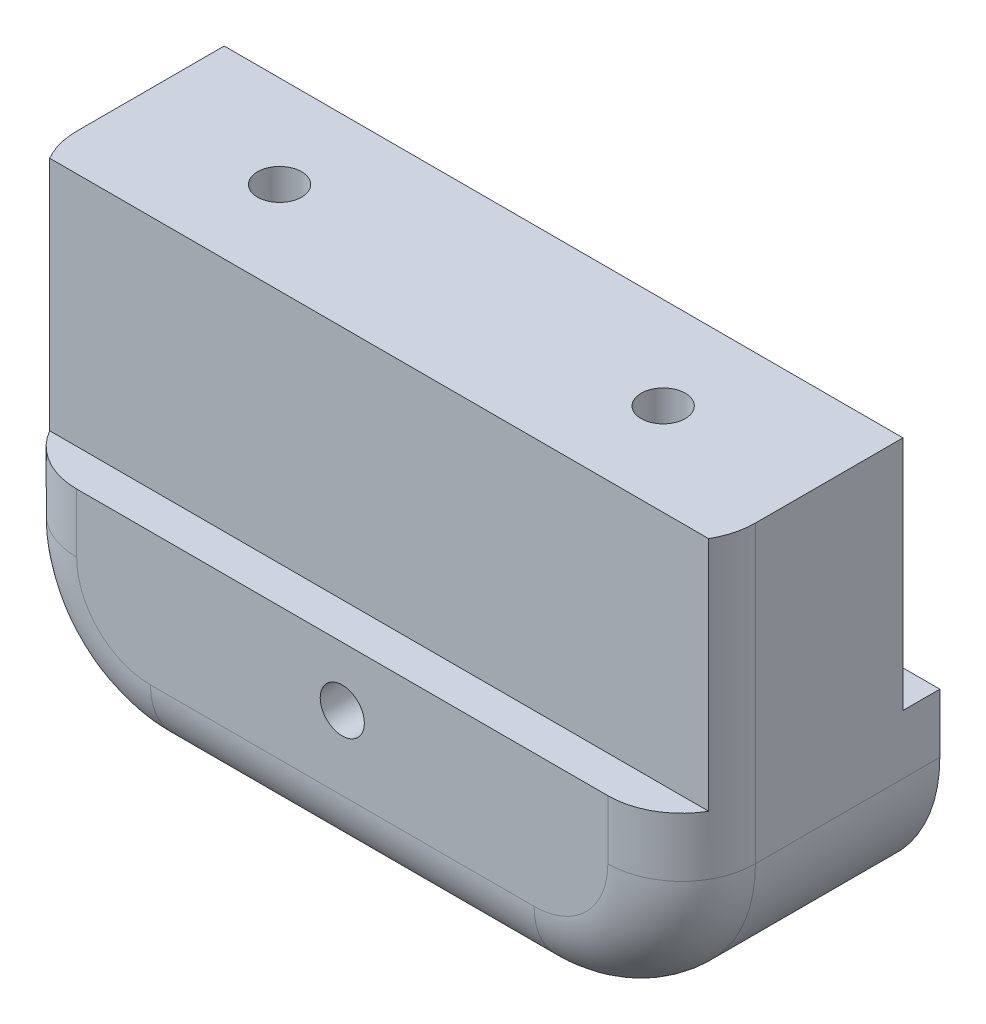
from build123d import *

# Parameters (mm, degrees)
BOSS_EXTRUDE1_DEPTH    = 22.225
F_10_24_TAPPED_HOLE2_D = 3.7973
SKETCH4_W              = 99.06
SKETCH4_H              = 20.32
CUT_EXTRUDE2_DEPTH     = 3.175
SKETCH5_W              = 51.587974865
SKETCH5_H              = 53.755536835
CUT_EXTRUDE3_DEPTH     = 251.743353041
FILLET3_R              = 12.7
FILLET4_R              = 6.35
SKETCH6_W              = 64.22208222
SKETCH6_H              = 21.64619408
CUT_EXTRUDE4_DEPTH     = 3.175
F_10_24_TAPPED_HOLE3_D = 3.7973


with BuildPart() as part:
    # Sketch1 → Boss-Extrude1 (new body)
    with BuildSketch(Plane.XY):
        with BuildLine():
            Line((161.925, -178.562), (85.725, -178.562))
            Line((85.725, -178.562), (75.565, -178.562))
            Line((75.565, -178.562), (75.565, -140.462))
            Line((75.565, -140.462), (174.625, -140.462))
            Line((174.625, -140.462), (174.625, -149.225))
            Line((174.625, -149.225), (174.625, -165.862))
            ThreePointArc((174.625, -165.862), (170.905256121, -174.842256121), (161.925, -178.562))
        make_face()
    extrude(amount=BOSS_EXTRUDE1_DEPTH)

    # 10-24 Tapped Hole2 (through all)
    with Locations(Plane(origin=(0, 0, 0), x_dir=(-1, 0, 0), z_dir=(0, 0, -1))):
        with Locations((-145.415, -165.862)):
            Hole(F_10_24_TAPPED_HOLE2_D / 2)

    # Sketch4 → Cut-Extrude2 (cut)
    with BuildSketch(Plane(origin=(0, 0, 22.225), x_dir=(-1, 0, 0), z_dir=(0, 0, -1))):
        with Locations((-125.095, -150.622)):
            Rectangle(SKETCH4_W, SKETCH4_H)
    extrude(amount=CUT_EXTRUDE2_DEPTH, mode=Mode.SUBTRACT)

    # Sketch5 → Cut-Extrude3 (cut, through all)
    with BuildSketch(Plane(origin=(0, 0, 0), x_dir=(-1, 0, 0), z_dir=(0, 0, -1))):
        with Locations((-90.411012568, -160.16226859)):
            Rectangle(SKETCH5_W, SKETCH5_H)
    extrude(amount=-CUT_EXTRUDE3_DEPTH, mode=Mode.SUBTRACT)

    # Fillet3
    fillet3_edges = [part.edges().sort_by_distance(p)[0] for p in [
        (116.205, -178.562, 11.1125),
    ]]
    fillet(fillet3_edges, radius=FILLET3_R)

    # Fillet4
    fillet4_edges = [part.edges().sort_by_distance(p)[0] for p in [
        (116.205, -163.322, 22.225),
        (119.924743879, -174.842256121, 22.225),
        (174.625, -163.322, 22.225),
        (170.905256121, -174.842256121, 22.225),
        (145.415, -178.562, 22.225),
    ]]
    fillet(fillet4_edges, radius=FILLET4_R)

    # Sketch6 → Cut-Extrude4 (cut)
    with BuildSketch(Plane(origin=(0, 0, 0), x_dir=(-1, 0, 0), z_dir=(0, 0, -1))):
        with Locations((-143.727636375, -149.95890296)):
            Rectangle(SKETCH6_W, SKETCH6_H)
    extrude(amount=-CUT_EXTRUDE4_DEPTH, mode=Mode.SUBTRACT)

    # 10-24 Tapped Hole3 (through all)
    with Locations(Plane(origin=(0, -140.462, 0), x_dir=(1, 0, 0), z_dir=(0, 1, 0))):
        with Locations((128.905, -11.1125), (161.925, -11.1125)):
            Hole(F_10_24_TAPPED_HOLE3_D / 2)


solid = part.part
